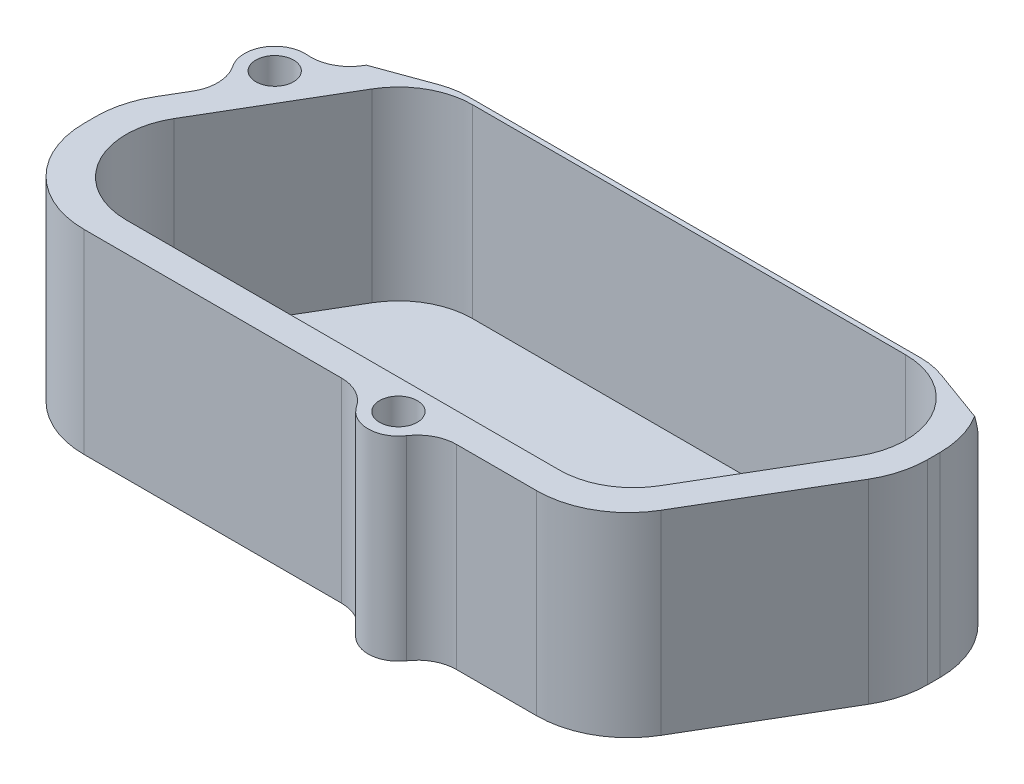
ISO-10303-21;
HEADER;
FILE_DESCRIPTION(('STEP AP214'),'2;1');
FILE_NAME('part.step','',(''),(''),'','','');
FILE_SCHEMA(('AUTOMOTIVE_DESIGN { 1 0 10303 214 1 1 1 1 }'));
ENDSEC;
DATA;
#1=APPLICATION_CONTEXT('core data for automotive mechanical design processes');
#2=APPLICATION_PROTOCOL_DEFINITION('international standard','automotive_design',2000,#1);
#3=PRODUCT_CONTEXT('',#1,'mechanical');
#4=PRODUCT('Part','Part','',(#3));
#5=PRODUCT_RELATED_PRODUCT_CATEGORY('part','',(#4));
#6=PRODUCT_DEFINITION_FORMATION('','',#4);
#7=PRODUCT_DEFINITION_CONTEXT('part definition',#1,'design');
#8=PRODUCT_DEFINITION('design','',#6,#7);
#9=PRODUCT_DEFINITION_SHAPE('','',#8);
#10=(LENGTH_UNIT() NAMED_UNIT(*) SI_UNIT(.MILLI.,.METRE.));
#11=(NAMED_UNIT(*) PLANE_ANGLE_UNIT() SI_UNIT($,.RADIAN.));
#12=(NAMED_UNIT(*) SI_UNIT($,.STERADIAN.) SOLID_ANGLE_UNIT());
#13=UNCERTAINTY_MEASURE_WITH_UNIT(LENGTH_MEASURE(1.E-05),#10,'distance_accuracy_value','');
#14=(GEOMETRIC_REPRESENTATION_CONTEXT(3) GLOBAL_UNCERTAINTY_ASSIGNED_CONTEXT((#13)) GLOBAL_UNIT_ASSIGNED_CONTEXT((#10,
#11,#12)) REPRESENTATION_CONTEXT('',''));
#15=CARTESIAN_POINT('',(0.,0.,0.));
#16=DIRECTION('',(0.,0.,1.));
#17=DIRECTION('',(1.,0.,0.));
#18=AXIS2_PLACEMENT_3D('',#15,#16,#17);
#19=CARTESIAN_POINT('',(37.7723012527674,25.4,-25.908));
#20=DIRECTION('',(0.,-1.,0.));
#21=DIRECTION('',(0.,0.,-1.));
#22=AXIS2_PLACEMENT_3D('',#19,#20,#21);
#23=CYLINDRICAL_SURFACE('',#22,9.652);
#24=DIRECTION('',(0.,-1.,0.));
#25=VECTOR('',#24,1.);
#26=CARTESIAN_POINT('',(37.7723012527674,25.4,-35.56));
#27=LINE('',#26,#25);
#28=CARTESIAN_POINT('',(37.7723012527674,25.4,-35.56));
#29=VERTEX_POINT('',#28);
#30=CARTESIAN_POINT('',(37.7723012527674,1.27,-35.56));
#31=VERTEX_POINT('',#30);
#32=EDGE_CURVE('E283',#29,#31,#27,.T.);
#33=ORIENTED_EDGE('',*,*,#32,.T.);
#34=CARTESIAN_POINT('',(37.7723012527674,1.27,-25.908));
#35=DIRECTION('',(0.,-1.,0.));
#36=DIRECTION('',(0.,0.,-1.));
#37=AXIS2_PLACEMENT_3D('',#34,#35,#36);
#38=CIRCLE('',#37,9.652);
#39=CARTESIAN_POINT('',(46.0926168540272,1.27,-21.0158172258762));
#40=VERTEX_POINT('',#39);
#41=EDGE_CURVE('E514',#31,#40,#38,.T.);
#42=ORIENTED_EDGE('',*,*,#41,.T.);
#43=DIRECTION('',(0.,-1.,0.));
#44=VECTOR('',#43,1.);
#45=CARTESIAN_POINT('',(46.0926168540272,25.4,-21.0158172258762));
#46=LINE('',#45,#44);
#47=CARTESIAN_POINT('',(46.0926168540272,25.4,-21.0158172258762));
#48=VERTEX_POINT('',#47);
#49=EDGE_CURVE('E491',#48,#40,#46,.T.);
#50=ORIENTED_EDGE('',*,*,#49,.F.);
#51=CARTESIAN_POINT('',(37.7723012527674,25.4,-25.908));
#52=DIRECTION('',(0.,1.,0.));
#53=DIRECTION('',(0.,0.,-1.));
#54=AXIS2_PLACEMENT_3D('',#51,#52,#53);
#55=CIRCLE('',#54,9.652);
#56=EDGE_CURVE('E475',#48,#29,#55,.T.);
#57=ORIENTED_EDGE('',*,*,#56,.T.);
#58=EDGE_LOOP('',(#33,#42,#50,#57));
#59=FACE_BOUND('',#58,.T.);
#60=ADVANCED_FACE('F47',(#59),#23,.F.);
#61=CARTESIAN_POINT('',(-18.655881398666,25.4,-35.56));
#62=DIRECTION('',(0.,0.,1.));
#63=DIRECTION('',(1.,0.,0.));
#64=AXIS2_PLACEMENT_3D('',#61,#62,#63);
#65=PLANE('',#64);
#66=DIRECTION('',(0.,-1.,0.));
#67=VECTOR('',#66,1.);
#68=CARTESIAN_POINT('',(-18.655881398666,25.4,-35.56));
#69=LINE('',#68,#67);
#70=CARTESIAN_POINT('',(-18.655881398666,25.4,-35.56));
#71=VERTEX_POINT('',#70);
#72=CARTESIAN_POINT('',(-18.655881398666,1.27,-35.56));
#73=VERTEX_POINT('',#72);
#74=EDGE_CURVE('E275',#71,#73,#69,.T.);
#75=ORIENTED_EDGE('',*,*,#74,.T.);
#76=DIRECTION('',(1.,0.,0.));
#77=VECTOR('',#76,1.);
#78=CARTESIAN_POINT('',(37.7723012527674,1.27,-35.56));
#79=LINE('',#78,#77);
#80=EDGE_CURVE('E517',#73,#31,#79,.T.);
#81=ORIENTED_EDGE('',*,*,#80,.T.);
#82=ORIENTED_EDGE('',*,*,#32,.F.);
#83=DIRECTION('',(-1.,0.,0.));
#84=VECTOR('',#83,1.);
#85=CARTESIAN_POINT('',(-18.655881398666,25.4,-35.56));
#86=LINE('',#85,#84);
#87=EDGE_CURVE('E477',#29,#71,#86,.T.);
#88=ORIENTED_EDGE('',*,*,#87,.T.);
#89=EDGE_LOOP('',(#75,#81,#82,#88));
#90=FACE_BOUND('',#89,.T.);
#91=ADVANCED_FACE('F633',(#90),#65,.T.);
#92=CARTESIAN_POINT('',(-18.655881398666,25.4,-25.908));
#93=DIRECTION('',(0.,-1.,0.));
#94=DIRECTION('',(0.,0.,-1.));
#95=AXIS2_PLACEMENT_3D('',#92,#93,#94);
#96=CYLINDRICAL_SURFACE('',#95,9.652);
#97=DIRECTION('',(0.,-1.,0.));
#98=VECTOR('',#97,1.);
#99=CARTESIAN_POINT('',(-26.9761969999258,25.4,-30.8001827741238));
#100=LINE('',#99,#98);
#101=CARTESIAN_POINT('',(-26.9761969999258,25.4,-30.8001827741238));
#102=VERTEX_POINT('',#101);
#103=CARTESIAN_POINT('',(-26.9761969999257,1.27,-30.8001827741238));
#104=VERTEX_POINT('',#103);
#105=EDGE_CURVE('E273',#102,#104,#100,.T.);
#106=ORIENTED_EDGE('',*,*,#105,.T.);
#107=CARTESIAN_POINT('',(-18.655881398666,1.27,-25.908));
#108=DIRECTION('',(0.,-1.,0.));
#109=DIRECTION('',(0.,0.,-1.));
#110=AXIS2_PLACEMENT_3D('',#107,#108,#109);
#111=CIRCLE('',#110,9.652);
#112=EDGE_CURVE('E255',#104,#73,#111,.T.);
#113=ORIENTED_EDGE('',*,*,#112,.T.);
#114=ORIENTED_EDGE('',*,*,#74,.F.);
#115=CARTESIAN_POINT('',(-18.655881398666,25.4,-25.908));
#116=DIRECTION('',(0.,1.,0.));
#117=DIRECTION('',(0.,0.,-1.));
#118=AXIS2_PLACEMENT_3D('',#115,#116,#117);
#119=CIRCLE('',#118,9.652);
#120=EDGE_CURVE('E479',#71,#102,#119,.T.);
#121=ORIENTED_EDGE('',*,*,#120,.T.);
#122=EDGE_LOOP('',(#106,#113,#114,#121));
#123=FACE_BOUND('',#122,.T.);
#124=ADVANCED_FACE('F639',(#123),#96,.F.);
#125=CARTESIAN_POINT('',(-36.5344069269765,25.4,-14.5441827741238));
#126=DIRECTION('',(0.862030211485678,0.,0.506856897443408));
#127=DIRECTION('',(0.506856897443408,0.,-0.862030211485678));
#128=AXIS2_PLACEMENT_3D('',#125,#126,#127);
#129=PLANE('',#128);
#130=DIRECTION('',(0.,-1.,0.));
#131=VECTOR('',#130,1.);
#132=CARTESIAN_POINT('',(-36.5344069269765,25.4,-14.5441827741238));
#133=LINE('',#132,#131);
#134=CARTESIAN_POINT('',(-36.5344069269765,25.4,-14.5441827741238));
#135=VERTEX_POINT('',#134);
#136=CARTESIAN_POINT('',(-36.5344069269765,1.27,-14.5441827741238));
#137=VERTEX_POINT('',#136);
#138=EDGE_CURVE('E265',#135,#137,#133,.T.);
#139=ORIENTED_EDGE('',*,*,#138,.T.);
#140=DIRECTION('',(0.506856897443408,0.,-0.862030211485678));
#141=VECTOR('',#140,1.);
#142=CARTESIAN_POINT('',(-26.9761969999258,1.27,-30.8001827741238));
#143=LINE('',#142,#141);
#144=EDGE_CURVE('E249',#137,#104,#143,.T.);
#145=ORIENTED_EDGE('',*,*,#144,.T.);
#146=ORIENTED_EDGE('',*,*,#105,.F.);
#147=DIRECTION('',(-0.506856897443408,0.,0.862030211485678));
#148=VECTOR('',#147,1.);
#149=CARTESIAN_POINT('',(-36.5344069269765,25.4,-14.5441827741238));
#150=LINE('',#149,#148);
#151=EDGE_CURVE('E272',#102,#135,#150,.T.);
#152=ORIENTED_EDGE('',*,*,#151,.T.);
#153=EDGE_LOOP('',(#139,#145,#146,#152));
#154=FACE_BOUND('',#153,.T.);
#155=ADVANCED_FACE('F270',(#154),#129,.T.);
#156=CARTESIAN_POINT('',(-28.2140913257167,25.4,-9.652));
#157=DIRECTION('',(0.,-1.,0.));
#158=DIRECTION('',(0.,0.,-1.));
#159=AXIS2_PLACEMENT_3D('',#156,#157,#158);
#160=CYLINDRICAL_SURFACE('',#159,9.652);
#161=DIRECTION('',(0.,-1.,0.));
#162=VECTOR('',#161,1.);
#163=CARTESIAN_POINT('',(-28.2140913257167,25.4,0.));
#164=LINE('',#163,#162);
#165=CARTESIAN_POINT('',(-28.2140913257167,25.4,0.));
#166=VERTEX_POINT('',#165);
#167=CARTESIAN_POINT('',(-28.2140913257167,1.27,0.));
#168=VERTEX_POINT('',#167);
#169=EDGE_CURVE('E268',#166,#168,#164,.T.);
#170=ORIENTED_EDGE('',*,*,#169,.T.);
#171=CARTESIAN_POINT('',(-28.2140913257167,1.27,-9.652));
#172=DIRECTION('',(0.,-1.,0.));
#173=DIRECTION('',(0.,0.,-1.));
#174=AXIS2_PLACEMENT_3D('',#171,#172,#173);
#175=CIRCLE('',#174,9.652);
#176=EDGE_CURVE('E252',#168,#137,#175,.T.);
#177=ORIENTED_EDGE('',*,*,#176,.T.);
#178=ORIENTED_EDGE('',*,*,#138,.F.);
#179=CARTESIAN_POINT('',(-28.2140913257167,25.4,-9.652));
#180=DIRECTION('',(0.,1.,0.));
#181=DIRECTION('',(0.,0.,-1.));
#182=AXIS2_PLACEMENT_3D('',#179,#180,#181);
#183=CIRCLE('',#182,9.652);
#184=EDGE_CURVE('E482',#135,#166,#183,.T.);
#185=ORIENTED_EDGE('',*,*,#184,.T.);
#186=EDGE_LOOP('',(#170,#177,#178,#185));
#187=FACE_BOUND('',#186,.T.);
#188=ADVANCED_FACE('F264',(#187),#160,.F.);
#189=CARTESIAN_POINT('',(-28.2140913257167,25.4,0.));
#190=DIRECTION('',(0.,0.,-1.));
#191=DIRECTION('',(-1.,0.,0.));
#192=AXIS2_PLACEMENT_3D('',#189,#190,#191);
#193=PLANE('',#192);
#194=DIRECTION('',(0.,-1.,0.));
#195=VECTOR('',#194,1.);
#196=CARTESIAN_POINT('',(28.2140913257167,25.4,0.));
#197=LINE('',#196,#195);
#198=CARTESIAN_POINT('',(28.2140913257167,25.4,0.));
#199=VERTEX_POINT('',#198);
#200=CARTESIAN_POINT('',(28.2140913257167,1.27,0.));
#201=VERTEX_POINT('',#200);
#202=EDGE_CURVE('E277',#199,#201,#197,.T.);
#203=ORIENTED_EDGE('',*,*,#202,.T.);
#204=DIRECTION('',(-1.,0.,0.));
#205=VECTOR('',#204,1.);
#206=CARTESIAN_POINT('',(-28.2140913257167,1.27,0.));
#207=LINE('',#206,#205);
#208=EDGE_CURVE('E500',#201,#168,#207,.T.);
#209=ORIENTED_EDGE('',*,*,#208,.T.);
#210=ORIENTED_EDGE('',*,*,#169,.F.);
#211=DIRECTION('',(1.,0.,0.));
#212=VECTOR('',#211,1.);
#213=CARTESIAN_POINT('',(-28.2140913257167,25.4,0.));
#214=LINE('',#213,#212);
#215=EDGE_CURVE('E484',#166,#199,#214,.T.);
#216=ORIENTED_EDGE('',*,*,#215,.T.);
#217=EDGE_LOOP('',(#203,#209,#210,#216));
#218=FACE_BOUND('',#217,.T.);
#219=ADVANCED_FACE('F499',(#218),#193,.T.);
#220=CARTESIAN_POINT('',(28.2140913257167,25.4,-9.652));
#221=DIRECTION('',(0.,-1.,0.));
#222=DIRECTION('',(0.,0.,-1.));
#223=AXIS2_PLACEMENT_3D('',#220,#221,#222);
#224=CYLINDRICAL_SURFACE('',#223,9.652);
#225=DIRECTION('',(0.,-1.,0.));
#226=VECTOR('',#225,1.);
#227=CARTESIAN_POINT('',(36.5344069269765,25.4,-4.75981722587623));
#228=LINE('',#227,#226);
#229=CARTESIAN_POINT('',(36.5344069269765,25.4,-4.75981722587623));
#230=VERTEX_POINT('',#229);
#231=CARTESIAN_POINT('',(36.5344069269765,1.27,-4.75981722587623));
#232=VERTEX_POINT('',#231);
#233=EDGE_CURVE('E494',#230,#232,#228,.T.);
#234=ORIENTED_EDGE('',*,*,#233,.T.);
#235=CARTESIAN_POINT('',(28.2140913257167,1.27,-9.652));
#236=DIRECTION('',(0.,-1.,0.));
#237=DIRECTION('',(0.,0.,-1.));
#238=AXIS2_PLACEMENT_3D('',#235,#236,#237);
#239=CIRCLE('',#238,9.652);
#240=EDGE_CURVE('E62',#232,#201,#239,.T.);
#241=ORIENTED_EDGE('',*,*,#240,.T.);
#242=ORIENTED_EDGE('',*,*,#202,.F.);
#243=CARTESIAN_POINT('',(28.2140913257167,25.4,-9.652));
#244=DIRECTION('',(0.,1.,0.));
#245=DIRECTION('',(0.,0.,-1.));
#246=AXIS2_PLACEMENT_3D('',#243,#244,#245);
#247=CIRCLE('',#246,9.652);
#248=EDGE_CURVE('E486',#199,#230,#247,.T.);
#249=ORIENTED_EDGE('',*,*,#248,.T.);
#250=EDGE_LOOP('',(#234,#241,#242,#249));
#251=FACE_BOUND('',#250,.T.);
#252=ADVANCED_FACE('F504',(#251),#224,.F.);
#253=CARTESIAN_POINT('',(36.5344069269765,25.4,-4.75981722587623));
#254=DIRECTION('',(-0.862030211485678,0.,-0.506856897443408));
#255=DIRECTION('',(-0.506856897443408,0.,0.862030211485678));
#256=AXIS2_PLACEMENT_3D('',#253,#254,#255);
#257=PLANE('',#256);
#258=ORIENTED_EDGE('',*,*,#49,.T.);
#259=DIRECTION('',(-0.506856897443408,0.,0.862030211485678));
#260=VECTOR('',#259,1.);
#261=CARTESIAN_POINT('',(36.5344069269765,1.27,-4.75981722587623));
#262=LINE('',#261,#260);
#263=EDGE_CURVE('E516',#40,#232,#262,.T.);
#264=ORIENTED_EDGE('',*,*,#263,.T.);
#265=ORIENTED_EDGE('',*,*,#233,.F.);
#266=DIRECTION('',(0.506856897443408,0.,-0.862030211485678));
#267=VECTOR('',#266,1.);
#268=CARTESIAN_POINT('',(36.5344069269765,25.4,-4.75981722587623));
#269=LINE('',#268,#267);
#270=EDGE_CURVE('E489',#230,#48,#269,.T.);
#271=ORIENTED_EDGE('',*,*,#270,.T.);
#272=EDGE_LOOP('',(#258,#264,#265,#271));
#273=FACE_BOUND('',#272,.T.);
#274=ADVANCED_FACE('F510',(#273),#257,.T.);
#275=CARTESIAN_POINT('',(-19.8884341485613,25.4,-26.7748836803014));
#276=DIRECTION('',(0.,-1.,0.));
#277=DIRECTION('',(0.,0.,-1.));
#278=AXIS2_PLACEMENT_3D('',#275,#276,#277);
#279=CYLINDRICAL_SURFACE('',#278,11.9601163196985);
#280=CARTESIAN_POINT('',(-19.8884341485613,51.2815568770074,-26.7748836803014));
#281=DIRECTION('',(0.32139380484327,-0.342020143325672,0.883022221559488));
#282=DIRECTION('',(-0.116977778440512,-0.939692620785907,-0.321393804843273));
#283=AXIS2_PLACEMENT_3D('',#280,#281,#282);
#284=ELLIPSE('',#283,34.9690407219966,11.9601163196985);
#285=CARTESIAN_POINT('',(-30.0351300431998,25.4,-33.1064668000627));
#286=VERTEX_POINT('',#285);
#287=CARTESIAN_POINT('',(-23.9790348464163,18.4214073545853,-38.0137167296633));
#288=VERTEX_POINT('',#287);
#289=EDGE_CURVE('E55',#286,#288,#284,.T.);
#290=ORIENTED_EDGE('',*,*,#289,.T.);
#291=CARTESIAN_POINT('',(-19.8884341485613,18.4214073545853,-26.7748836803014));
#292=DIRECTION('',(0.,1.,0.));
#293=DIRECTION('',(0.,0.,-1.));
#294=AXIS2_PLACEMENT_3D('',#291,#292,#293);
#295=CIRCLE('',#294,11.9601163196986);
#296=CARTESIAN_POINT('',(-19.8884341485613,18.4214073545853,-38.735));
#297=VERTEX_POINT('',#296);
#298=EDGE_CURVE('E70',#297,#288,#295,.T.);
#299=ORIENTED_EDGE('',*,*,#298,.F.);
#300=DIRECTION('',(0.,-1.,0.));
#301=VECTOR('',#300,1.);
#302=CARTESIAN_POINT('',(-19.8884341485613,25.4,-38.735));
#303=LINE('',#302,#301);
#304=CARTESIAN_POINT('',(-19.8884341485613,0.,-38.735));
#305=VERTEX_POINT('',#304);
#306=EDGE_CURVE('E359',#297,#305,#303,.T.);
#307=ORIENTED_EDGE('',*,*,#306,.T.);
#308=CARTESIAN_POINT('',(-19.8884341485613,0.,-26.7748836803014));
#309=DIRECTION('',(0.,1.,0.));
#310=DIRECTION('',(0.,0.,-1.));
#311=AXIS2_PLACEMENT_3D('',#308,#309,#310);
#312=CIRCLE('',#311,11.9601163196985);
#313=CARTESIAN_POINT('',(-30.1744395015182,0.,-32.8775450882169));
#314=VERTEX_POINT('',#313);
#315=EDGE_CURVE('E350',#305,#314,#312,.T.);
#316=ORIENTED_EDGE('',*,*,#315,.T.);
#317=DIRECTION('',(0.,-1.,0.));
#318=VECTOR('',#317,1.);
#319=CARTESIAN_POINT('',(-30.1744395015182,25.4,-32.8775450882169));
#320=LINE('',#319,#318);
#321=CARTESIAN_POINT('',(-30.1744395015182,25.4,-32.8775450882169));
#322=VERTEX_POINT('',#321);
#323=EDGE_CURVE('E402',#314,#322,#320,.F.);
#324=ORIENTED_EDGE('',*,*,#323,.T.);
#325=CARTESIAN_POINT('',(-19.8884341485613,25.4,-26.7748836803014));
#326=DIRECTION('',(0.,1.,0.));
#327=DIRECTION('',(0.,0.,-1.));
#328=AXIS2_PLACEMENT_3D('',#325,#326,#327);
#329=CIRCLE('',#328,11.9601163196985);
#330=EDGE_CURVE('E314',#286,#322,#329,.T.);
#331=ORIENTED_EDGE('',*,*,#330,.F.);
#332=EDGE_LOOP('',(#290,#299,#307,#316,#324,#331));
#333=FACE_BOUND('',#332,.T.);
#334=ADVANCED_FACE('F426',(#333),#279,.T.);
#335=CARTESIAN_POINT('',(-29.889431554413,25.4,-9.76581869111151));
#336=DIRECTION('',(0.,-1.,0.));
#337=DIRECTION('',(0.,0.,-1.));
#338=AXIS2_PLACEMENT_3D('',#335,#336,#337);
#339=PLANE('',#338);
#340=CARTESIAN_POINT('',(-35.3451967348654,25.4,-26.4883418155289));
#341=DIRECTION('',(0.,1.,0.));
#342=DIRECTION('',(0.,0.,1.));
#343=AXIS2_PLACEMENT_3D('',#340,#341,#342);
#344=CIRCLE('',#343,2.45745);
#345=CARTESIAN_POINT('',(-35.3451967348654,25.4,-24.0308918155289));
#346=VERTEX_POINT('',#345);
#347=EDGE_CURVE('E439',#346,#346,#344,.T.);
#348=ORIENTED_EDGE('',*,*,#347,.F.);
#349=EDGE_LOOP('',(#348));
#350=FACE_BOUND('',#349,.T.);
#351=CARTESIAN_POINT('',(11.1336691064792,25.4,3.87715503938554));
#352=DIRECTION('',(0.,1.,0.));
#353=DIRECTION('',(0.,0.,1.));
#354=AXIS2_PLACEMENT_3D('',#351,#352,#353);
#355=CIRCLE('',#354,2.45745);
#356=CARTESIAN_POINT('',(11.1336691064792,25.4,6.33460503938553));
#357=VERTEX_POINT('',#356);
#358=EDGE_CURVE('E469',#357,#357,#355,.T.);
#359=ORIENTED_EDGE('',*,*,#358,.F.);
#360=EDGE_LOOP('',(#359));
#361=FACE_BOUND('',#360,.T.);
#362=CARTESIAN_POINT('',(39.0742739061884,25.4,-26.7748836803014));
#363=DIRECTION('',(0.,1.,0.));
#364=DIRECTION('',(0.,0.,-1.));
#365=AXIS2_PLACEMENT_3D('',#362,#363,#364);
#366=CIRCLE('',#365,11.9601163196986);
#367=CARTESIAN_POINT('',(51.0343902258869,25.4,-26.7748836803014));
#368=VERTEX_POINT('',#367);
#369=CARTESIAN_POINT('',(49.2209698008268,25.4,-33.1064668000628));
#370=VERTEX_POINT('',#369);
#371=EDGE_CURVE('E311',#368,#370,#366,.T.);
#372=ORIENTED_EDGE('',*,*,#371,.T.);
#373=DIRECTION('',(-0.939692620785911,0.,-0.342020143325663));
#374=VECTOR('',#373,1.);
#375=CARTESIAN_POINT('',(54.2302397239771,25.4,-31.2832416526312));
#376=LINE('',#375,#374);
#377=CARTESIAN_POINT('',(42.2961434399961,25.4,-35.6268974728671));
#378=VERTEX_POINT('',#377);
#379=EDGE_CURVE('E462',#370,#378,#376,.T.);
#380=ORIENTED_EDGE('',*,*,#379,.T.);
#381=CARTESIAN_POINT('',(39.0742739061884,25.4,-26.7748836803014));
#382=DIRECTION('',(0.,1.,0.));
#383=DIRECTION('',(0.342020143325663,0.,-0.93969262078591));
#384=AXIS2_PLACEMENT_3D('',#381,#382,#383);
#385=CIRCLE('',#384,9.42011631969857);
#386=CARTESIAN_POINT('',(39.0742739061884,25.4,-36.195));
#387=VERTEX_POINT('',#386);
#388=EDGE_CURVE('E452',#378,#387,#385,.T.);
#389=ORIENTED_EDGE('',*,*,#388,.T.);
#390=DIRECTION('',(-1.,0.,0.));
#391=VECTOR('',#390,1.);
#392=CARTESIAN_POINT('',(39.0742739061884,25.4,-36.195));
#393=LINE('',#392,#391);
#394=CARTESIAN_POINT('',(-19.8884341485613,25.4,-36.195));
#395=VERTEX_POINT('',#394);
#396=EDGE_CURVE('E457',#387,#395,#393,.T.);
#397=ORIENTED_EDGE('',*,*,#396,.T.);
#398=CARTESIAN_POINT('',(-19.8884341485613,25.4,-26.7748836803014));
#399=DIRECTION('',(0.,1.,0.));
#400=DIRECTION('',(0.,0.,-1.));
#401=AXIS2_PLACEMENT_3D('',#398,#399,#400);
#402=CIRCLE('',#401,9.42011631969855);
#403=CARTESIAN_POINT('',(-23.1103036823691,25.4,-35.6268974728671));
#404=VERTEX_POINT('',#403);
#405=EDGE_CURVE('E438',#395,#404,#402,.T.);
#406=ORIENTED_EDGE('',*,*,#405,.T.);
#407=DIRECTION('',(-0.939692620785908,0.,0.342020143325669));
#408=VECTOR('',#407,1.);
#409=CARTESIAN_POINT('',(-23.1103036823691,25.4,-35.6268974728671));
#410=LINE('',#409,#408);
#411=EDGE_CURVE('E431',#404,#286,#410,.T.);
#412=ORIENTED_EDGE('',*,*,#411,.T.);
#413=ORIENTED_EDGE('',*,*,#330,.T.);
#414=CARTESIAN_POINT('',(-34.5433691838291,25.4,-35.4696202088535));
#415=DIRECTION('',(0.,-1.,0.));
#416=DIRECTION('',(0.,0.,-1.));
#417=AXIS2_PLACEMENT_3D('',#414,#415,#416);
#418=CIRCLE('',#417,5.08);
#419=CARTESIAN_POINT('',(-34.9951030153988,25.4,-30.4097450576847));
#420=VERTEX_POINT('',#419);
#421=EDGE_CURVE('E418',#322,#420,#418,.T.);
#422=ORIENTED_EDGE('',*,*,#421,.T.);
#423=CARTESIAN_POINT('',(-35.3451967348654,25.4,-26.4883418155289));
#424=DIRECTION('',(0.,1.,0.));
#425=DIRECTION('',(0.,0.,1.));
#426=AXIS2_PLACEMENT_3D('',#423,#424,#425);
#427=CIRCLE('',#426,3.937);
#428=CARTESIAN_POINT('',(-38.6017455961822,25.4,-24.2759091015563));
#429=VERTEX_POINT('',#428);
#430=EDGE_CURVE('E316',#420,#429,#427,.T.);
#431=ORIENTED_EDGE('',*,*,#430,.T.);
#432=CARTESIAN_POINT('',(-42.8037441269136,25.4,-21.4211572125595));
#433=DIRECTION('',(0.,-1.,0.));
#434=DIRECTION('',(0.,0.,-1.));
#435=AXIS2_PLACEMENT_3D('',#432,#433,#434);
#436=CIRCLE('',#435,5.08);
#437=CARTESIAN_POINT('',(-38.4246306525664,25.4,-18.846324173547));
#438=VERTEX_POINT('',#437);
#439=EDGE_CURVE('E422',#429,#438,#436,.T.);
#440=ORIENTED_EDGE('',*,*,#439,.T.);
#441=DIRECTION('',(-0.506856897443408,0.,0.862030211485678));
#442=VECTOR('',#441,1.);
#443=CARTESIAN_POINT('',(-40.1994131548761,25.4,-15.8278861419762));
#444=LINE('',#443,#442);
#445=CARTESIAN_POINT('',(-40.1994131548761,25.4,-15.8278861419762));
#446=VERTEX_POINT('',#445);
#447=EDGE_CURVE('E319',#438,#446,#444,.T.);
#448=ORIENTED_EDGE('',*,*,#447,.T.);
#449=CARTESIAN_POINT('',(-29.889431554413,25.4,-9.76581869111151));
#450=DIRECTION('',(0.,1.,0.));
#451=DIRECTION('',(0.,0.,-1.));
#452=AXIS2_PLACEMENT_3D('',#449,#450,#451);
#453=CIRCLE('',#452,11.9601163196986);
#454=CARTESIAN_POINT('',(-41.8495478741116,25.4,-9.7658186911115));
#455=VERTEX_POINT('',#454);
#456=EDGE_CURVE('E287',#446,#455,#453,.T.);
#457=ORIENTED_EDGE('',*,*,#456,.T.);
#458=DIRECTION('',(0.,0.,1.));
#459=VECTOR('',#458,1.);
#460=CARTESIAN_POINT('',(-41.8495478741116,25.4,-9.7658186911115));
#461=LINE('',#460,#459);
#462=CARTESIAN_POINT('',(-41.8495478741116,25.4,-8.15011631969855));
#463=VERTEX_POINT('',#462);
#464=EDGE_CURVE('E290',#455,#463,#461,.T.);
#465=ORIENTED_EDGE('',*,*,#464,.T.);
#466=CARTESIAN_POINT('',(-29.889431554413,25.4,-8.15011631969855));
#467=DIRECTION('',(0.,1.,0.));
#468=DIRECTION('',(0.,0.,-1.));
#469=AXIS2_PLACEMENT_3D('',#466,#467,#468);
#470=CIRCLE('',#469,11.9601163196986);
#471=CARTESIAN_POINT('',(-29.889431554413,25.4,3.81000000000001));
#472=VERTEX_POINT('',#471);
#473=EDGE_CURVE('E293',#463,#472,#470,.T.);
#474=ORIENTED_EDGE('',*,*,#473,.T.);
#475=DIRECTION('',(1.,0.,0.));
#476=VECTOR('',#475,1.);
#477=CARTESIAN_POINT('',(7.19724189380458,25.4,3.81));
#478=LINE('',#477,#476);
#479=CARTESIAN_POINT('',(3.63849236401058,25.4,3.81));
#480=VERTEX_POINT('',#479);
#481=EDGE_CURVE('E295',#472,#480,#478,.T.);
#482=ORIENTED_EDGE('',*,*,#481,.T.);
#483=CARTESIAN_POINT('',(3.63849236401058,25.4,8.89));
#484=DIRECTION('',(0.,-1.,0.));
#485=DIRECTION('',(0.,0.,-1.));
#486=AXIS2_PLACEMENT_3D('',#483,#484,#485);
#487=CIRCLE('',#486,5.08);
#488=CARTESIAN_POINT('',(7.86112714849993,25.4,6.06586199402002));
#489=VERTEX_POINT('',#488);
#490=EDGE_CURVE('E414',#480,#489,#487,.T.);
#491=ORIENTED_EDGE('',*,*,#490,.T.);
#492=CARTESIAN_POINT('',(11.1336691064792,25.4,3.87715503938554));
#493=DIRECTION('',(0.,1.,0.));
#494=DIRECTION('',(0.,0.,1.));
#495=AXIS2_PLACEMENT_3D('',#492,#493,#494);
#496=CIRCLE('',#495,3.937);
#497=CARTESIAN_POINT('',(14.4062110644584,25.4,6.06586199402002));
#498=VERTEX_POINT('',#497);
#499=EDGE_CURVE('E298',#489,#498,#496,.T.);
#500=ORIENTED_EDGE('',*,*,#499,.T.);
#501=CARTESIAN_POINT('',(18.6288458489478,25.4,8.89));
#502=DIRECTION('',(0.,-1.,0.));
#503=DIRECTION('',(0.,0.,-1.));
#504=AXIS2_PLACEMENT_3D('',#501,#502,#503);
#505=CIRCLE('',#504,5.08);
#506=CARTESIAN_POINT('',(18.6288458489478,25.4,3.81));
#507=VERTEX_POINT('',#506);
#508=EDGE_CURVE('E410',#498,#507,#505,.T.);
#509=ORIENTED_EDGE('',*,*,#508,.T.);
#510=DIRECTION('',(1.,0.,0.));
#511=VECTOR('',#510,1.);
#512=CARTESIAN_POINT('',(29.0732765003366,25.4,3.81));
#513=LINE('',#512,#511);
#514=CARTESIAN_POINT('',(29.0732765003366,25.4,3.81000000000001));
#515=VERTEX_POINT('',#514);
#516=EDGE_CURVE('E301',#507,#515,#513,.T.);
#517=ORIENTED_EDGE('',*,*,#516,.T.);
#518=CARTESIAN_POINT('',(29.0732765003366,25.4,-8.15011631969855));
#519=DIRECTION('',(0.,1.,0.));
#520=DIRECTION('',(0.,0.,-1.));
#521=AXIS2_PLACEMENT_3D('',#518,#519,#520);
#522=CIRCLE('',#521,11.9601163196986);
#523=CARTESIAN_POINT('',(39.3832581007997,25.4,-2.08804886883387));
#524=VERTEX_POINT('',#523);
#525=EDGE_CURVE('E303',#515,#524,#522,.T.);
#526=ORIENTED_EDGE('',*,*,#525,.T.);
#527=DIRECTION('',(0.506856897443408,0.,-0.862030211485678));
#528=VECTOR('',#527,1.);
#529=CARTESIAN_POINT('',(39.3832581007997,25.4,-2.08804886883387));
#530=LINE('',#529,#528);
#531=CARTESIAN_POINT('',(49.3842555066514,25.4,-19.0971138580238));
#532=VERTEX_POINT('',#531);
#533=EDGE_CURVE('E305',#524,#532,#530,.T.);
#534=ORIENTED_EDGE('',*,*,#533,.T.);
#535=CARTESIAN_POINT('',(39.0742739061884,25.4,-25.1591813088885));
#536=DIRECTION('',(0.,1.,0.));
#537=DIRECTION('',(0.,0.,-1.));
#538=AXIS2_PLACEMENT_3D('',#535,#536,#537);
#539=CIRCLE('',#538,11.9601163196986);
#540=CARTESIAN_POINT('',(51.0343902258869,25.4,-25.1591813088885));
#541=VERTEX_POINT('',#540);
#542=EDGE_CURVE('E307',#532,#541,#539,.T.);
#543=ORIENTED_EDGE('',*,*,#542,.T.);
#544=DIRECTION('',(0.,0.,-1.));
#545=VECTOR('',#544,1.);
#546=CARTESIAN_POINT('',(51.0343902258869,25.4,-26.7748836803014));
#547=LINE('',#546,#545);
#548=EDGE_CURVE('E309',#541,#368,#547,.T.);
#549=ORIENTED_EDGE('',*,*,#548,.T.);
#550=EDGE_LOOP('',(#372,#380,#389,#397,#406,#412,#413,#422,#431,#440,#448,#457,#465,#474,#482,
#491,#500,#509,#517,#526,#534,#543,#549));
#551=FACE_BOUND('',#550,.T.);
#552=ORIENTED_EDGE('',*,*,#56,.F.);
#553=ORIENTED_EDGE('',*,*,#270,.F.);
#554=ORIENTED_EDGE('',*,*,#248,.F.);
#555=ORIENTED_EDGE('',*,*,#215,.F.);
#556=ORIENTED_EDGE('',*,*,#184,.F.);
#557=ORIENTED_EDGE('',*,*,#151,.F.);
#558=ORIENTED_EDGE('',*,*,#120,.F.);
#559=ORIENTED_EDGE('',*,*,#87,.F.);
#560=EDGE_LOOP('',(#552,#553,#554,#555,#556,#557,#558,#559));
#561=FACE_BOUND('',#560,.T.);
#562=ADVANCED_FACE('F435',(#350,#361,#551,#561),#339,.F.);
#563=CARTESIAN_POINT('',(-29.889431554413,0.,-9.76581869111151));
#564=DIRECTION('',(0.,-1.,0.));
#565=DIRECTION('',(0.,0.,-1.));
#566=AXIS2_PLACEMENT_3D('',#563,#564,#565);
#567=PLANE('',#566);
#568=CARTESIAN_POINT('',(-35.3451967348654,0.,-26.4883418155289));
#569=DIRECTION('',(0.,1.,0.));
#570=DIRECTION('',(0.,0.,1.));
#571=AXIS2_PLACEMENT_3D('',#568,#569,#570);
#572=CIRCLE('',#571,2.45744999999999);
#573=CARTESIAN_POINT('',(-35.3451967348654,0.,-24.0308918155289));
#574=VERTEX_POINT('',#573);
#575=EDGE_CURVE('E442',#574,#574,#572,.T.);
#576=ORIENTED_EDGE('',*,*,#575,.T.);
#577=EDGE_LOOP('',(#576));
#578=FACE_BOUND('',#577,.T.);
#579=CARTESIAN_POINT('',(11.1336691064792,0.,3.87715503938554));
#580=DIRECTION('',(0.,1.,0.));
#581=DIRECTION('',(0.,0.,1.));
#582=AXIS2_PLACEMENT_3D('',#579,#580,#581);
#583=CIRCLE('',#582,2.45744999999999);
#584=CARTESIAN_POINT('',(11.1336691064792,0.,6.33460503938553));
#585=VERTEX_POINT('',#584);
#586=EDGE_CURVE('E472',#585,#585,#583,.T.);
#587=ORIENTED_EDGE('',*,*,#586,.T.);
#588=EDGE_LOOP('',(#587));
#589=FACE_BOUND('',#588,.T.);
#590=CARTESIAN_POINT('',(-29.889431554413,0.,-9.76581869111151));
#591=DIRECTION('',(0.,1.,0.));
#592=DIRECTION('',(0.,0.,-1.));
#593=AXIS2_PLACEMENT_3D('',#590,#591,#592);
#594=CIRCLE('',#593,11.9601163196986);
#595=CARTESIAN_POINT('',(-40.1994131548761,0.,-15.8278861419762));
#596=VERTEX_POINT('',#595);
#597=CARTESIAN_POINT('',(-41.8495478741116,0.,-9.7658186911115));
#598=VERTEX_POINT('',#597);
#599=EDGE_CURVE('E286',#596,#598,#594,.T.);
#600=ORIENTED_EDGE('',*,*,#599,.F.);
#601=DIRECTION('',(-0.506856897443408,0.,0.862030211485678));
#602=VECTOR('',#601,1.);
#603=CARTESIAN_POINT('',(-40.1994131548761,0.,-15.8278861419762));
#604=LINE('',#603,#602);
#605=CARTESIAN_POINT('',(-38.4246306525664,0.,-18.846324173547));
#606=VERTEX_POINT('',#605);
#607=EDGE_CURVE('E291',#606,#596,#604,.T.);
#608=ORIENTED_EDGE('',*,*,#607,.F.);
#609=CARTESIAN_POINT('',(-42.8037441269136,0.,-21.4211572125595));
#610=DIRECTION('',(0.,-1.,0.));
#611=DIRECTION('',(0.,0.,-1.));
#612=AXIS2_PLACEMENT_3D('',#609,#610,#611);
#613=CIRCLE('',#612,5.08);
#614=CARTESIAN_POINT('',(-38.6017455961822,0.,-24.2759091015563));
#615=VERTEX_POINT('',#614);
#616=EDGE_CURVE('E420',#606,#615,#613,.F.);
#617=ORIENTED_EDGE('',*,*,#616,.T.);
#618=CARTESIAN_POINT('',(-35.3451967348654,0.,-26.4883418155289));
#619=DIRECTION('',(0.,1.,0.));
#620=DIRECTION('',(0.,0.,1.));
#621=AXIS2_PLACEMENT_3D('',#618,#619,#620);
#622=CIRCLE('',#621,3.937);
#623=CARTESIAN_POINT('',(-34.9951030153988,0.,-30.4097450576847));
#624=VERTEX_POINT('',#623);
#625=EDGE_CURVE('E353',#624,#615,#622,.T.);
#626=ORIENTED_EDGE('',*,*,#625,.F.);
#627=CARTESIAN_POINT('',(-34.5433691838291,0.,-35.4696202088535));
#628=DIRECTION('',(0.,-1.,0.));
#629=DIRECTION('',(0.,0.,-1.));
#630=AXIS2_PLACEMENT_3D('',#627,#628,#629);
#631=CIRCLE('',#630,5.08);
#632=EDGE_CURVE('E416',#624,#314,#631,.F.);
#633=ORIENTED_EDGE('',*,*,#632,.T.);
#634=ORIENTED_EDGE('',*,*,#315,.F.);
#635=DIRECTION('',(-1.,0.,0.));
#636=VECTOR('',#635,1.);
#637=CARTESIAN_POINT('',(-19.8884341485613,0.,-38.735));
#638=LINE('',#637,#636);
#639=CARTESIAN_POINT('',(39.0742739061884,0.,-38.735));
#640=VERTEX_POINT('',#639);
#641=EDGE_CURVE('E347',#640,#305,#638,.T.);
#642=ORIENTED_EDGE('',*,*,#641,.F.);
#643=CARTESIAN_POINT('',(39.0742739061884,0.,-26.7748836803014));
#644=DIRECTION('',(0.,1.,0.));
#645=DIRECTION('',(0.,0.,-1.));
#646=AXIS2_PLACEMENT_3D('',#643,#644,#645);
#647=CIRCLE('',#646,11.9601163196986);
#648=CARTESIAN_POINT('',(51.0343902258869,0.,-26.7748836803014));
#649=VERTEX_POINT('',#648);
#650=EDGE_CURVE('E344',#649,#640,#647,.T.);
#651=ORIENTED_EDGE('',*,*,#650,.F.);
#652=DIRECTION('',(0.,0.,-1.));
#653=VECTOR('',#652,1.);
#654=CARTESIAN_POINT('',(51.0343902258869,0.,-26.7748836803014));
#655=LINE('',#654,#653);
#656=CARTESIAN_POINT('',(51.0343902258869,0.,-25.1591813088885));
#657=VERTEX_POINT('',#656);
#658=EDGE_CURVE('E342',#657,#649,#655,.T.);
#659=ORIENTED_EDGE('',*,*,#658,.F.);
#660=CARTESIAN_POINT('',(39.0742739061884,0.,-25.1591813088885));
#661=DIRECTION('',(0.,1.,0.));
#662=DIRECTION('',(0.,0.,-1.));
#663=AXIS2_PLACEMENT_3D('',#660,#661,#662);
#664=CIRCLE('',#663,11.9601163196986);
#665=CARTESIAN_POINT('',(49.3842555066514,0.,-19.0971138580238));
#666=VERTEX_POINT('',#665);
#667=EDGE_CURVE('E340',#666,#657,#664,.T.);
#668=ORIENTED_EDGE('',*,*,#667,.F.);
#669=DIRECTION('',(0.506856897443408,0.,-0.862030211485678));
#670=VECTOR('',#669,1.);
#671=CARTESIAN_POINT('',(39.3832581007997,0.,-2.08804886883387));
#672=LINE('',#671,#670);
#673=CARTESIAN_POINT('',(39.3832581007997,0.,-2.08804886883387));
#674=VERTEX_POINT('',#673);
#675=EDGE_CURVE('E338',#674,#666,#672,.T.);
#676=ORIENTED_EDGE('',*,*,#675,.F.);
#677=CARTESIAN_POINT('',(29.0732765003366,0.,-8.15011631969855));
#678=DIRECTION('',(0.,1.,0.));
#679=DIRECTION('',(0.,0.,-1.));
#680=AXIS2_PLACEMENT_3D('',#677,#678,#679);
#681=CIRCLE('',#680,11.9601163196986);
#682=CARTESIAN_POINT('',(29.0732765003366,0.,3.81000000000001));
#683=VERTEX_POINT('',#682);
#684=EDGE_CURVE('E336',#683,#674,#681,.T.);
#685=ORIENTED_EDGE('',*,*,#684,.F.);
#686=DIRECTION('',(1.,0.,0.));
#687=VECTOR('',#686,1.);
#688=CARTESIAN_POINT('',(29.0732765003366,0.,3.81));
#689=LINE('',#688,#687);
#690=CARTESIAN_POINT('',(18.6288458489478,0.,3.81));
#691=VERTEX_POINT('',#690);
#692=EDGE_CURVE('E334',#691,#683,#689,.T.);
#693=ORIENTED_EDGE('',*,*,#692,.F.);
#694=CARTESIAN_POINT('',(18.6288458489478,0.,8.89));
#695=DIRECTION('',(0.,-1.,0.));
#696=DIRECTION('',(0.,0.,-1.));
#697=AXIS2_PLACEMENT_3D('',#694,#695,#696);
#698=CIRCLE('',#697,5.08);
#699=CARTESIAN_POINT('',(14.4062110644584,0.,6.06586199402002));
#700=VERTEX_POINT('',#699);
#701=EDGE_CURVE('E408',#691,#700,#698,.F.);
#702=ORIENTED_EDGE('',*,*,#701,.T.);
#703=CARTESIAN_POINT('',(11.1336691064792,0.,3.87715503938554));
#704=DIRECTION('',(0.,1.,0.));
#705=DIRECTION('',(0.,0.,1.));
#706=AXIS2_PLACEMENT_3D('',#703,#704,#705);
#707=CIRCLE('',#706,3.937);
#708=CARTESIAN_POINT('',(7.86112714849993,0.,6.06586199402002));
#709=VERTEX_POINT('',#708);
#710=EDGE_CURVE('E331',#709,#700,#707,.T.);
#711=ORIENTED_EDGE('',*,*,#710,.F.);
#712=CARTESIAN_POINT('',(3.63849236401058,0.,8.89));
#713=DIRECTION('',(0.,-1.,0.));
#714=DIRECTION('',(0.,0.,-1.));
#715=AXIS2_PLACEMENT_3D('',#712,#713,#714);
#716=CIRCLE('',#715,5.08);
#717=CARTESIAN_POINT('',(3.63849236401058,0.,3.81));
#718=VERTEX_POINT('',#717);
#719=EDGE_CURVE('E412',#709,#718,#716,.F.);
#720=ORIENTED_EDGE('',*,*,#719,.T.);
#721=DIRECTION('',(1.,0.,0.));
#722=VECTOR('',#721,1.);
#723=CARTESIAN_POINT('',(7.19724189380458,0.,3.81));
#724=LINE('',#723,#722);
#725=CARTESIAN_POINT('',(-29.889431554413,0.,3.81000000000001));
#726=VERTEX_POINT('',#725);
#727=EDGE_CURVE('E328',#726,#718,#724,.T.);
#728=ORIENTED_EDGE('',*,*,#727,.F.);
#729=CARTESIAN_POINT('',(-29.889431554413,0.,-8.15011631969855));
#730=DIRECTION('',(0.,1.,0.));
#731=DIRECTION('',(0.,0.,-1.));
#732=AXIS2_PLACEMENT_3D('',#729,#730,#731);
#733=CIRCLE('',#732,11.9601163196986);
#734=CARTESIAN_POINT('',(-41.8495478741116,0.,-8.15011631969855));
#735=VERTEX_POINT('',#734);
#736=EDGE_CURVE('E326',#735,#726,#733,.T.);
#737=ORIENTED_EDGE('',*,*,#736,.F.);
#738=DIRECTION('',(0.,0.,1.));
#739=VECTOR('',#738,1.);
#740=CARTESIAN_POINT('',(-41.8495478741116,0.,-9.7658186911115));
#741=LINE('',#740,#739);
#742=EDGE_CURVE('E324',#598,#735,#741,.T.);
#743=ORIENTED_EDGE('',*,*,#742,.F.);
#744=EDGE_LOOP('',(#600,#608,#617,#626,#633,#634,#642,#651,#659,#668,#676,#685,#693,#702,#711,
#720,#728,#737,#743));
#745=FACE_BOUND('',#744,.T.);
#746=ADVANCED_FACE('F548',(#578,#589,#745),#567,.T.);
#747=CARTESIAN_POINT('',(-29.889431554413,25.4,-9.76581869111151));
#748=DIRECTION('',(0.,-1.,0.));
#749=DIRECTION('',(0.,0.,-1.));
#750=AXIS2_PLACEMENT_3D('',#747,#748,#749);
#751=CYLINDRICAL_SURFACE('',#750,11.9601163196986);
#752=ORIENTED_EDGE('',*,*,#599,.T.);
#753=DIRECTION('',(0.,-1.,0.));
#754=VECTOR('',#753,1.);
#755=CARTESIAN_POINT('',(-41.8495478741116,25.4,-9.7658186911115));
#756=LINE('',#755,#754);
#757=EDGE_CURVE('E384',#455,#598,#756,.T.);
#758=ORIENTED_EDGE('',*,*,#757,.F.);
#759=ORIENTED_EDGE('',*,*,#456,.F.);
#760=DIRECTION('',(0.,-1.,0.));
#761=VECTOR('',#760,1.);
#762=CARTESIAN_POINT('',(-40.1994131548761,25.4,-15.8278861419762));
#763=LINE('',#762,#761);
#764=EDGE_CURVE('E321',#446,#596,#763,.T.);
#765=ORIENTED_EDGE('',*,*,#764,.T.);
#766=EDGE_LOOP('',(#752,#758,#759,#765));
#767=FACE_BOUND('',#766,.T.);
#768=ADVANCED_FACE('F570',(#767),#751,.T.);
#769=CARTESIAN_POINT('',(-41.8495478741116,25.4,-9.7658186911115));
#770=DIRECTION('',(1.,0.,0.));
#771=DIRECTION('',(0.,0.,-1.));
#772=AXIS2_PLACEMENT_3D('',#769,#770,#771);
#773=PLANE('',#772);
#774=ORIENTED_EDGE('',*,*,#742,.T.);
#775=DIRECTION('',(0.,-1.,0.));
#776=VECTOR('',#775,1.);
#777=CARTESIAN_POINT('',(-41.8495478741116,25.4,-8.15011631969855));
#778=LINE('',#777,#776);
#779=EDGE_CURVE('E381',#463,#735,#778,.T.);
#780=ORIENTED_EDGE('',*,*,#779,.F.);
#781=ORIENTED_EDGE('',*,*,#464,.F.);
#782=ORIENTED_EDGE('',*,*,#757,.T.);
#783=EDGE_LOOP('',(#774,#780,#781,#782));
#784=FACE_BOUND('',#783,.T.);
#785=ADVANCED_FACE('F575',(#784),#773,.F.);
#786=CARTESIAN_POINT('',(-29.889431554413,25.4,-8.15011631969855));
#787=DIRECTION('',(0.,-1.,0.));
#788=DIRECTION('',(0.,0.,-1.));
#789=AXIS2_PLACEMENT_3D('',#786,#787,#788);
#790=CYLINDRICAL_SURFACE('',#789,11.9601163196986);
#791=ORIENTED_EDGE('',*,*,#736,.T.);
#792=DIRECTION('',(0.,-1.,0.));
#793=VECTOR('',#792,1.);
#794=CARTESIAN_POINT('',(-29.889431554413,25.4,3.81000000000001));
#795=LINE('',#794,#793);
#796=EDGE_CURVE('E378',#472,#726,#795,.T.);
#797=ORIENTED_EDGE('',*,*,#796,.F.);
#798=ORIENTED_EDGE('',*,*,#473,.F.);
#799=ORIENTED_EDGE('',*,*,#779,.T.);
#800=EDGE_LOOP('',(#791,#797,#798,#799));
#801=FACE_BOUND('',#800,.T.);
#802=ADVANCED_FACE('F578',(#801),#790,.T.);
#803=CARTESIAN_POINT('',(7.19724189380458,25.4,3.81));
#804=DIRECTION('',(0.,0.,-1.));
#805=DIRECTION('',(-1.,0.,0.));
#806=AXIS2_PLACEMENT_3D('',#803,#804,#805);
#807=PLANE('',#806);
#808=ORIENTED_EDGE('',*,*,#727,.T.);
#809=DIRECTION('',(0.,1.,0.));
#810=VECTOR('',#809,1.);
#811=CARTESIAN_POINT('',(3.63849236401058,25.4,3.81));
#812=LINE('',#811,#810);
#813=EDGE_CURVE('E395',#718,#480,#812,.T.);
#814=ORIENTED_EDGE('',*,*,#813,.T.);
#815=ORIENTED_EDGE('',*,*,#481,.F.);
#816=ORIENTED_EDGE('',*,*,#796,.T.);
#817=EDGE_LOOP('',(#808,#814,#815,#816));
#818=FACE_BOUND('',#817,.T.);
#819=ADVANCED_FACE('F582',(#818),#807,.F.);
#820=CARTESIAN_POINT('',(11.1336691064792,25.4,3.87715503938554));
#821=DIRECTION('',(0.,-1.,0.));
#822=DIRECTION('',(0.,0.,-1.));
#823=AXIS2_PLACEMENT_3D('',#820,#821,#822);
#824=CYLINDRICAL_SURFACE('',#823,3.937);
#825=ORIENTED_EDGE('',*,*,#710,.T.);
#826=DIRECTION('',(0.,-1.,0.));
#827=VECTOR('',#826,1.);
#828=CARTESIAN_POINT('',(14.4062110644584,25.4,6.06586199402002));
#829=LINE('',#828,#827);
#830=EDGE_CURVE('E393',#700,#498,#829,.F.);
#831=ORIENTED_EDGE('',*,*,#830,.T.);
#832=ORIENTED_EDGE('',*,*,#499,.F.);
#833=DIRECTION('',(0.,-1.,0.));
#834=VECTOR('',#833,1.);
#835=CARTESIAN_POINT('',(7.86112714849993,25.4,6.06586199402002));
#836=LINE('',#835,#834);
#837=EDGE_CURVE('E390',#489,#709,#836,.T.);
#838=ORIENTED_EDGE('',*,*,#837,.T.);
#839=EDGE_LOOP('',(#825,#831,#832,#838));
#840=FACE_BOUND('',#839,.T.);
#841=ADVANCED_FACE('F591',(#840),#824,.T.);
#842=CARTESIAN_POINT('',(29.0732765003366,25.4,3.81));
#843=DIRECTION('',(0.,0.,-1.));
#844=DIRECTION('',(-1.,0.,0.));
#845=AXIS2_PLACEMENT_3D('',#842,#843,#844);
#846=PLANE('',#845);
#847=ORIENTED_EDGE('',*,*,#516,.F.);
#848=DIRECTION('',(0.,1.,0.));
#849=VECTOR('',#848,1.);
#850=CARTESIAN_POINT('',(18.6288458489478,0.,3.81));
#851=LINE('',#850,#849);
#852=EDGE_CURVE('E387',#507,#691,#851,.F.);
#853=ORIENTED_EDGE('',*,*,#852,.T.);
#854=ORIENTED_EDGE('',*,*,#692,.T.);
#855=DIRECTION('',(0.,-1.,0.));
#856=VECTOR('',#855,1.);
#857=CARTESIAN_POINT('',(29.0732765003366,25.4,3.81000000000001));
#858=LINE('',#857,#856);
#859=EDGE_CURVE('E375',#515,#683,#858,.T.);
#860=ORIENTED_EDGE('',*,*,#859,.F.);
#861=EDGE_LOOP('',(#847,#853,#854,#860));
#862=FACE_BOUND('',#861,.T.);
#863=ADVANCED_FACE('F601',(#862),#846,.F.);
#864=CARTESIAN_POINT('',(29.0732765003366,25.4,-8.15011631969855));
#865=DIRECTION('',(0.,-1.,0.));
#866=DIRECTION('',(0.,0.,-1.));
#867=AXIS2_PLACEMENT_3D('',#864,#865,#866);
#868=CYLINDRICAL_SURFACE('',#867,11.9601163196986);
#869=ORIENTED_EDGE('',*,*,#684,.T.);
#870=DIRECTION('',(0.,-1.,0.));
#871=VECTOR('',#870,1.);
#872=CARTESIAN_POINT('',(39.3832581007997,25.4,-2.08804886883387));
#873=LINE('',#872,#871);
#874=EDGE_CURVE('E372',#524,#674,#873,.T.);
#875=ORIENTED_EDGE('',*,*,#874,.F.);
#876=ORIENTED_EDGE('',*,*,#525,.F.);
#877=ORIENTED_EDGE('',*,*,#859,.T.);
#878=EDGE_LOOP('',(#869,#875,#876,#877));
#879=FACE_BOUND('',#878,.T.);
#880=ADVANCED_FACE('F608',(#879),#868,.T.);
#881=CARTESIAN_POINT('',(39.3832581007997,25.4,-2.08804886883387));
#882=DIRECTION('',(-0.862030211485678,0.,-0.506856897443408));
#883=DIRECTION('',(-0.506856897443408,0.,0.862030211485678));
#884=AXIS2_PLACEMENT_3D('',#881,#882,#883);
#885=PLANE('',#884);
#886=ORIENTED_EDGE('',*,*,#675,.T.);
#887=DIRECTION('',(0.,-1.,0.));
#888=VECTOR('',#887,1.);
#889=CARTESIAN_POINT('',(49.3842555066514,25.4,-19.0971138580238));
#890=LINE('',#889,#888);
#891=EDGE_CURVE('E369',#532,#666,#890,.T.);
#892=ORIENTED_EDGE('',*,*,#891,.F.);
#893=ORIENTED_EDGE('',*,*,#533,.F.);
#894=ORIENTED_EDGE('',*,*,#874,.T.);
#895=EDGE_LOOP('',(#886,#892,#893,#894));
#896=FACE_BOUND('',#895,.T.);
#897=ADVANCED_FACE('F611',(#896),#885,.F.);
#898=CARTESIAN_POINT('',(39.0742739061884,25.4,-25.1591813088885));
#899=DIRECTION('',(0.,-1.,0.));
#900=DIRECTION('',(0.,0.,-1.));
#901=AXIS2_PLACEMENT_3D('',#898,#899,#900);
#902=CYLINDRICAL_SURFACE('',#901,11.9601163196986);
#903=ORIENTED_EDGE('',*,*,#667,.T.);
#904=DIRECTION('',(0.,-1.,0.));
#905=VECTOR('',#904,1.);
#906=CARTESIAN_POINT('',(51.0343902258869,25.4,-25.1591813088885));
#907=LINE('',#906,#905);
#908=EDGE_CURVE('E366',#541,#657,#907,.T.);
#909=ORIENTED_EDGE('',*,*,#908,.F.);
#910=ORIENTED_EDGE('',*,*,#542,.F.);
#911=ORIENTED_EDGE('',*,*,#891,.T.);
#912=EDGE_LOOP('',(#903,#909,#910,#911));
#913=FACE_BOUND('',#912,.T.);
#914=ADVANCED_FACE('F616',(#913),#902,.T.);
#915=CARTESIAN_POINT('',(51.0343902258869,25.4,-26.7748836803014));
#916=DIRECTION('',(-1.,0.,0.));
#917=DIRECTION('',(0.,0.,1.));
#918=AXIS2_PLACEMENT_3D('',#915,#916,#917);
#919=PLANE('',#918);
#920=ORIENTED_EDGE('',*,*,#658,.T.);
#921=DIRECTION('',(0.,-1.,0.));
#922=VECTOR('',#921,1.);
#923=CARTESIAN_POINT('',(51.0343902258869,25.4,-26.7748836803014));
#924=LINE('',#923,#922);
#925=EDGE_CURVE('E363',#368,#649,#924,.T.);
#926=ORIENTED_EDGE('',*,*,#925,.F.);
#927=ORIENTED_EDGE('',*,*,#548,.F.);
#928=ORIENTED_EDGE('',*,*,#908,.T.);
#929=EDGE_LOOP('',(#920,#926,#927,#928));
#930=FACE_BOUND('',#929,.T.);
#931=ADVANCED_FACE('F619',(#930),#919,.F.);
#932=CARTESIAN_POINT('',(39.0742739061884,25.4,-26.7748836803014));
#933=DIRECTION('',(0.,-1.,0.));
#934=DIRECTION('',(0.,0.,-1.));
#935=AXIS2_PLACEMENT_3D('',#932,#933,#934);
#936=CYLINDRICAL_SURFACE('',#935,11.9601163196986);
#937=CARTESIAN_POINT('',(39.0742739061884,18.4214073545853,-26.7748836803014));
#938=DIRECTION('',(0.,1.,0.));
#939=DIRECTION('',(0.342020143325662,0.,-0.939692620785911));
#940=AXIS2_PLACEMENT_3D('',#937,#938,#939);
#941=CIRCLE('',#940,11.9601163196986);
#942=CARTESIAN_POINT('',(43.1648746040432,18.4214073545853,-38.0137167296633));
#943=VERTEX_POINT('',#942);
#944=CARTESIAN_POINT('',(39.0742739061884,18.4214073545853,-38.735));
#945=VERTEX_POINT('',#944);
#946=EDGE_CURVE('E448',#943,#945,#941,.T.);
#947=ORIENTED_EDGE('',*,*,#946,.F.);
#948=CARTESIAN_POINT('',(39.0742739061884,51.2815568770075,-26.7748836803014));
#949=DIRECTION('',(-0.321393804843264,-0.342020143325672,0.88302222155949));
#950=DIRECTION('',(0.11697777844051,-0.939692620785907,-0.321393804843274));
#951=AXIS2_PLACEMENT_3D('',#948,#949,#950);
#952=ELLIPSE('',#951,34.9690407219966,11.9601163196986);
#953=EDGE_CURVE('E13',#943,#370,#952,.T.);
#954=ORIENTED_EDGE('',*,*,#953,.T.);
#955=ORIENTED_EDGE('',*,*,#371,.F.);
#956=ORIENTED_EDGE('',*,*,#925,.T.);
#957=ORIENTED_EDGE('',*,*,#650,.T.);
#958=DIRECTION('',(0.,-1.,0.));
#959=VECTOR('',#958,1.);
#960=CARTESIAN_POINT('',(39.0742739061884,25.4,-38.735));
#961=LINE('',#960,#959);
#962=EDGE_CURVE('E361',#945,#640,#961,.T.);
#963=ORIENTED_EDGE('',*,*,#962,.F.);
#964=EDGE_LOOP('',(#947,#954,#955,#956,#957,#963));
#965=FACE_BOUND('',#964,.T.);
#966=ADVANCED_FACE('F539',(#965),#936,.T.);
#967=CARTESIAN_POINT('',(-19.8884341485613,25.4,-38.735));
#968=DIRECTION('',(0.,0.,1.));
#969=DIRECTION('',(1.,0.,0.));
#970=AXIS2_PLACEMENT_3D('',#967,#968,#969);
#971=PLANE('',#970);
#972=ORIENTED_EDGE('',*,*,#306,.F.);
#973=DIRECTION('',(-1.,0.,0.));
#974=VECTOR('',#973,1.);
#975=CARTESIAN_POINT('',(39.0742739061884,18.4214073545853,-38.735));
#976=LINE('',#975,#974);
#977=EDGE_CURVE('E453',#945,#297,#976,.T.);
#978=ORIENTED_EDGE('',*,*,#977,.F.);
#979=ORIENTED_EDGE('',*,*,#962,.T.);
#980=ORIENTED_EDGE('',*,*,#641,.T.);
#981=EDGE_LOOP('',(#972,#978,#979,#980));
#982=FACE_BOUND('',#981,.T.);
#983=ADVANCED_FACE('F538',(#982),#971,.F.);
#984=CARTESIAN_POINT('',(-35.3451967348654,25.4,-26.4883418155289));
#985=DIRECTION('',(0.,-1.,0.));
#986=DIRECTION('',(0.,0.,-1.));
#987=AXIS2_PLACEMENT_3D('',#984,#985,#986);
#988=CYLINDRICAL_SURFACE('',#987,3.937);
#989=ORIENTED_EDGE('',*,*,#430,.F.);
#990=DIRECTION('',(0.,-1.,0.));
#991=VECTOR('',#990,1.);
#992=CARTESIAN_POINT('',(-34.9951030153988,25.4,-30.4097450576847));
#993=LINE('',#992,#991);
#994=EDGE_CURVE('E399',#420,#624,#993,.T.);
#995=ORIENTED_EDGE('',*,*,#994,.T.);
#996=ORIENTED_EDGE('',*,*,#625,.T.);
#997=DIRECTION('',(0.,-1.,0.));
#998=VECTOR('',#997,1.);
#999=CARTESIAN_POINT('',(-38.6017455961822,25.4,-24.2759091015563));
#1000=LINE('',#999,#998);
#1001=EDGE_CURVE('E397',#615,#429,#1000,.F.);
#1002=ORIENTED_EDGE('',*,*,#1001,.T.);
#1003=EDGE_LOOP('',(#989,#995,#996,#1002));
#1004=FACE_BOUND('',#1003,.T.);
#1005=ADVANCED_FACE('F558',(#1004),#988,.T.);
#1006=CARTESIAN_POINT('',(-40.1994131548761,25.4,-15.8278861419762));
#1007=DIRECTION('',(0.862030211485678,0.,0.506856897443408));
#1008=DIRECTION('',(0.506856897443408,0.,-0.862030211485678));
#1009=AXIS2_PLACEMENT_3D('',#1006,#1007,#1008);
#1010=PLANE('',#1009);
#1011=ORIENTED_EDGE('',*,*,#447,.F.);
#1012=DIRECTION('',(0.,1.,0.));
#1013=VECTOR('',#1012,1.);
#1014=CARTESIAN_POINT('',(-38.4246306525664,0.,-18.846324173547));
#1015=LINE('',#1014,#1013);
#1016=EDGE_CURVE('E405',#438,#606,#1015,.F.);
#1017=ORIENTED_EDGE('',*,*,#1016,.T.);
#1018=ORIENTED_EDGE('',*,*,#607,.T.);
#1019=ORIENTED_EDGE('',*,*,#764,.F.);
#1020=EDGE_LOOP('',(#1011,#1017,#1018,#1019));
#1021=FACE_BOUND('',#1020,.T.);
#1022=ADVANCED_FACE('F565',(#1021),#1010,.F.);
#1023=CARTESIAN_POINT('',(11.1336691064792,25.4,3.87715503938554));
#1024=DIRECTION('',(0.,1.,0.));
#1025=DIRECTION('',(0.,0.,1.));
#1026=AXIS2_PLACEMENT_3D('',#1023,#1024,#1025);
#1027=CYLINDRICAL_SURFACE('',#1026,2.45745);
#1028=ORIENTED_EDGE('',*,*,#586,.F.);
#1029=EDGE_LOOP('',(#1028));
#1030=FACE_BOUND('',#1029,.T.);
#1031=ORIENTED_EDGE('',*,*,#358,.T.);
#1032=EDGE_LOOP('',(#1031));
#1033=FACE_BOUND('',#1032,.T.);
#1034=ADVANCED_FACE('F652',(#1030,#1033),#1027,.F.);
#1035=CARTESIAN_POINT('',(-35.3451967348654,25.4,-26.4883418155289));
#1036=DIRECTION('',(0.,1.,0.));
#1037=DIRECTION('',(0.,0.,1.));
#1038=AXIS2_PLACEMENT_3D('',#1035,#1036,#1037);
#1039=CYLINDRICAL_SURFACE('',#1038,2.45745);
#1040=ORIENTED_EDGE('',*,*,#575,.F.);
#1041=EDGE_LOOP('',(#1040));
#1042=FACE_BOUND('',#1041,.T.);
#1043=ORIENTED_EDGE('',*,*,#347,.T.);
#1044=EDGE_LOOP('',(#1043));
#1045=FACE_BOUND('',#1044,.T.);
#1046=ADVANCED_FACE('F683',(#1042,#1045),#1039,.F.);
#1047=CARTESIAN_POINT('',(18.6288458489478,25.4,8.89));
#1048=DIRECTION('',(0.,-1.,0.));
#1049=DIRECTION('',(0.,0.,-1.));
#1050=AXIS2_PLACEMENT_3D('',#1047,#1048,#1049);
#1051=CYLINDRICAL_SURFACE('',#1050,5.08);
#1052=ORIENTED_EDGE('',*,*,#508,.F.);
#1053=ORIENTED_EDGE('',*,*,#830,.F.);
#1054=ORIENTED_EDGE('',*,*,#701,.F.);
#1055=ORIENTED_EDGE('',*,*,#852,.F.);
#1056=EDGE_LOOP('',(#1052,#1053,#1054,#1055));
#1057=FACE_BOUND('',#1056,.T.);
#1058=ADVANCED_FACE('F598',(#1057),#1051,.F.);
#1059=CARTESIAN_POINT('',(3.63849236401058,25.4,8.89));
#1060=DIRECTION('',(0.,-1.,0.));
#1061=DIRECTION('',(0.,0.,-1.));
#1062=AXIS2_PLACEMENT_3D('',#1059,#1060,#1061);
#1063=CYLINDRICAL_SURFACE('',#1062,5.08);
#1064=ORIENTED_EDGE('',*,*,#490,.F.);
#1065=ORIENTED_EDGE('',*,*,#813,.F.);
#1066=ORIENTED_EDGE('',*,*,#719,.F.);
#1067=ORIENTED_EDGE('',*,*,#837,.F.);
#1068=EDGE_LOOP('',(#1064,#1065,#1066,#1067));
#1069=FACE_BOUND('',#1068,.T.);
#1070=ADVANCED_FACE('F588',(#1069),#1063,.F.);
#1071=CARTESIAN_POINT('',(-34.5433691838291,25.4,-35.4696202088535));
#1072=DIRECTION('',(0.,1.,0.));
#1073=DIRECTION('',(0.,0.,1.));
#1074=AXIS2_PLACEMENT_3D('',#1071,#1072,#1073);
#1075=CYLINDRICAL_SURFACE('',#1074,5.08);
#1076=ORIENTED_EDGE('',*,*,#421,.F.);
#1077=ORIENTED_EDGE('',*,*,#323,.F.);
#1078=ORIENTED_EDGE('',*,*,#632,.F.);
#1079=ORIENTED_EDGE('',*,*,#994,.F.);
#1080=EDGE_LOOP('',(#1076,#1077,#1078,#1079));
#1081=FACE_BOUND('',#1080,.T.);
#1082=ADVANCED_FACE('F553',(#1081),#1075,.F.);
#1083=CARTESIAN_POINT('',(-42.8037441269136,25.4,-21.4211572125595));
#1084=DIRECTION('',(0.,-1.,0.));
#1085=DIRECTION('',(0.,0.,-1.));
#1086=AXIS2_PLACEMENT_3D('',#1083,#1084,#1085);
#1087=CYLINDRICAL_SURFACE('',#1086,5.08);
#1088=ORIENTED_EDGE('',*,*,#439,.F.);
#1089=ORIENTED_EDGE('',*,*,#1001,.F.);
#1090=ORIENTED_EDGE('',*,*,#616,.F.);
#1091=ORIENTED_EDGE('',*,*,#1016,.F.);
#1092=EDGE_LOOP('',(#1088,#1089,#1090,#1091));
#1093=FACE_BOUND('',#1092,.T.);
#1094=ADVANCED_FACE('F49',(#1093),#1087,.F.);
#1095=CARTESIAN_POINT('',(54.2302397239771,25.4,-31.2832416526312));
#1096=DIRECTION('',(-0.321393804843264,-0.342020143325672,0.88302222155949));
#1097=DIRECTION('',(0.,-0.932495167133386,-0.36118245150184));
#1098=AXIS2_PLACEMENT_3D('',#1095,#1096,#1097);
#1099=PLANE('',#1098);
#1100=DIRECTION('',(-0.116977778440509,0.939692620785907,0.321393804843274));
#1101=VECTOR('',#1100,1.);
#1102=CARTESIAN_POINT('',(42.2961434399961,25.4,-35.6268974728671));
#1103=LINE('',#1102,#1101);
#1104=EDGE_CURVE('E459',#943,#378,#1103,.T.);
#1105=ORIENTED_EDGE('',*,*,#1104,.T.);
#1106=ORIENTED_EDGE('',*,*,#379,.F.);
#1107=ORIENTED_EDGE('',*,*,#953,.F.);
#1108=EDGE_LOOP('',(#1105,#1106,#1107));
#1109=FACE_BOUND('',#1108,.T.);
#1110=ADVANCED_FACE('F621',(#1109),#1099,.F.);
#1111=CARTESIAN_POINT('',(-23.1103036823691,25.4,-35.6268974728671));
#1112=DIRECTION('',(0.32139380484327,-0.342020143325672,0.883022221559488));
#1113=DIRECTION('',(0.,-0.932495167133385,-0.361182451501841));
#1114=AXIS2_PLACEMENT_3D('',#1111,#1112,#1113);
#1115=PLANE('',#1114);
#1116=ORIENTED_EDGE('',*,*,#411,.F.);
#1117=DIRECTION('',(0.116977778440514,0.939692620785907,0.321393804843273));
#1118=VECTOR('',#1117,1.);
#1119=CARTESIAN_POINT('',(-23.1103036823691,25.4,-35.6268974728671));
#1120=LINE('',#1119,#1118);
#1121=EDGE_CURVE('E432',#288,#404,#1120,.T.);
#1122=ORIENTED_EDGE('',*,*,#1121,.F.);
#1123=ORIENTED_EDGE('',*,*,#289,.F.);
#1124=EDGE_LOOP('',(#1116,#1122,#1123));
#1125=FACE_BOUND('',#1124,.T.);
#1126=ADVANCED_FACE('F430',(#1125),#1115,.F.);
#1127=CARTESIAN_POINT('',(39.0742739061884,18.4214073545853,-26.7748836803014));
#1128=DIRECTION('',(0.,-1.,0.));
#1129=DIRECTION('',(0.,0.,-1.));
#1130=AXIS2_PLACEMENT_3D('',#1127,#1128,#1129);
#1131=CONICAL_SURFACE('',#1130,11.9601163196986,0.34906585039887);
#1132=DIRECTION('',(0.,0.939692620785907,0.342020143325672));
#1133=VECTOR('',#1132,1.);
#1134=CARTESIAN_POINT('',(39.0742739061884,25.4,-36.195));
#1135=LINE('',#1134,#1133);
#1136=EDGE_CURVE('E451',#945,#387,#1135,.T.);
#1137=ORIENTED_EDGE('',*,*,#1136,.T.);
#1138=ORIENTED_EDGE('',*,*,#388,.F.);
#1139=ORIENTED_EDGE('',*,*,#1104,.F.);
#1140=ORIENTED_EDGE('',*,*,#946,.T.);
#1141=EDGE_LOOP('',(#1137,#1138,#1139,#1140));
#1142=FACE_BOUND('',#1141,.T.);
#1143=ADVANCED_FACE('F531',(#1142),#1131,.T.);
#1144=CARTESIAN_POINT('',(39.0742739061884,25.4,-36.195));
#1145=DIRECTION('',(0.,-0.342020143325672,0.939692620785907));
#1146=DIRECTION('',(0.,-0.939692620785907,-0.342020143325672));
#1147=AXIS2_PLACEMENT_3D('',#1144,#1145,#1146);
#1148=PLANE('',#1147);
#1149=DIRECTION('',(0.,0.939692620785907,0.342020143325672));
#1150=VECTOR('',#1149,1.);
#1151=CARTESIAN_POINT('',(-19.8884341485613,25.4,-36.195));
#1152=LINE('',#1151,#1150);
#1153=EDGE_CURVE('E456',#297,#395,#1152,.T.);
#1154=ORIENTED_EDGE('',*,*,#1153,.T.);
#1155=ORIENTED_EDGE('',*,*,#396,.F.);
#1156=ORIENTED_EDGE('',*,*,#1136,.F.);
#1157=ORIENTED_EDGE('',*,*,#977,.T.);
#1158=EDGE_LOOP('',(#1154,#1155,#1156,#1157));
#1159=FACE_BOUND('',#1158,.T.);
#1160=ADVANCED_FACE('F529',(#1159),#1148,.F.);
#1161=CARTESIAN_POINT('',(-19.8884341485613,18.4214073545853,-26.7748836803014));
#1162=DIRECTION('',(0.,-1.,0.));
#1163=DIRECTION('',(0.,0.,-1.));
#1164=AXIS2_PLACEMENT_3D('',#1161,#1162,#1163);
#1165=CONICAL_SURFACE('',#1164,11.9601163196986,0.34906585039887);
#1166=ORIENTED_EDGE('',*,*,#1121,.T.);
#1167=ORIENTED_EDGE('',*,*,#405,.F.);
#1168=ORIENTED_EDGE('',*,*,#1153,.F.);
#1169=ORIENTED_EDGE('',*,*,#298,.T.);
#1170=EDGE_LOOP('',(#1166,#1167,#1168,#1169));
#1171=FACE_BOUND('',#1170,.T.);
#1172=ADVANCED_FACE('F629',(#1171),#1165,.T.);
#1173=CARTESIAN_POINT('',(-28.2140913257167,1.27,-9.652));
#1174=DIRECTION('',(0.,-1.,0.));
#1175=DIRECTION('',(0.,0.,-1.));
#1176=AXIS2_PLACEMENT_3D('',#1173,#1174,#1175);
#1177=PLANE('',#1176);
#1178=ORIENTED_EDGE('',*,*,#176,.F.);
#1179=ORIENTED_EDGE('',*,*,#208,.F.);
#1180=ORIENTED_EDGE('',*,*,#240,.F.);
#1181=ORIENTED_EDGE('',*,*,#263,.F.);
#1182=ORIENTED_EDGE('',*,*,#41,.F.);
#1183=ORIENTED_EDGE('',*,*,#80,.F.);
#1184=ORIENTED_EDGE('',*,*,#112,.F.);
#1185=ORIENTED_EDGE('',*,*,#144,.F.);
#1186=EDGE_LOOP('',(#1178,#1179,#1180,#1181,#1182,#1183,#1184,#1185));
#1187=FACE_BOUND('',#1186,.T.);
#1188=ADVANCED_FACE('F251',(#1187),#1177,.F.);
#1189=CLOSED_SHELL('',(#60,#91,#124,#155,#188,#219,#252,#274,#334,#562,#746,#768,#785,#802,#819,
#841,#863,#880,#897,#914,#931,#966,#983,#1005,#1022,#1034,#1046,#1058,#1070,#1082,#1094,#1110,
#1126,#1143,#1160,#1172,#1188));
#1190=MANIFOLD_SOLID_BREP('B2',#1189);
#1191=ADVANCED_BREP_SHAPE_REPRESENTATION('',(#18,#1190),#14);
#1192=SHAPE_DEFINITION_REPRESENTATION(#9,#1191);
ENDSEC;
END-ISO-10303-21;
